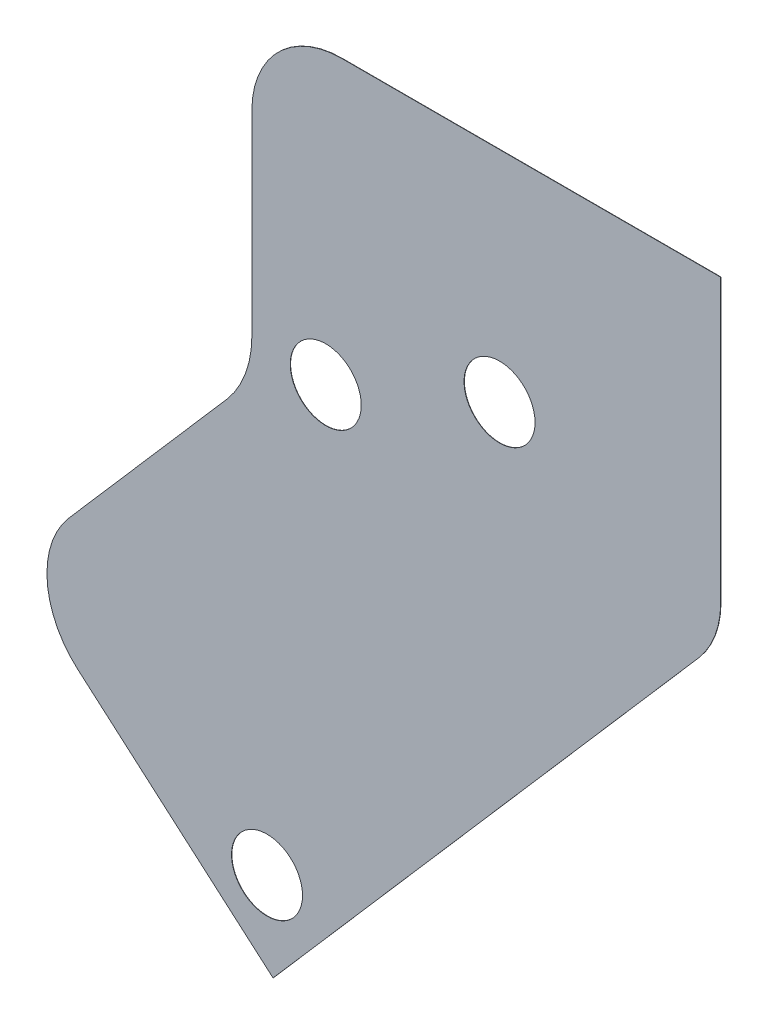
from build123d import *

# Parameters (mm, degrees)
BOSS_EXTRUDE1_DEPTH = 0.0254
HOLE1_D             = 5.6134


with BuildPart() as part:
    # Sketch1 → Boss-Extrude1 (new body)
    with BuildSketch(Plane.XY):
        with BuildLine():
            Line((-664.083, -35.989792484), (-664.083, -13.707872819))
            Line((-664.083, -13.707872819), (-694.055, -13.707872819))
            ThreePointArc((-694.055, -13.707872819), (-699.083943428, -15.790929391), (-701.167, -20.819872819))
            Line((-701.167, -20.819872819), (-701.167, -36.282075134))
            ThreePointArc((-701.167, -36.282075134), (-701.681033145, -39.126700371), (-703.158115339, -41.61152451))
            Line((-703.158115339, -41.61152451), (-715.634869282, -55.97856217))
            ThreePointArc((-715.634869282, -55.97856217), (-717.359527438, -61.141405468), (-714.928363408, -66.011604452))
            Line((-714.928363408, -66.011604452), (-699.490262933, -79.41850054))
            Line((-699.490262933, -79.41850054), (-665.825225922, -40.653060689))
            ThreePointArc((-665.825225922, -40.653060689), (-664.532779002, -38.478839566), (-664.083, -35.989792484))
        make_face()
    extrude(amount=BOSS_EXTRUDE1_DEPTH)

    # Hole1 (through all)
    with Locations(Plane(origin=(-698.979260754, -26.093732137, 0.0254), x_dir=(1, 0, 0), z_dir=(0, 0, 1))):
        with Locations((3.654260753, -10.601140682), (17.402464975, -4.91486015), (-0.99041688, -46.516632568)):
            Hole(HOLE1_D / 2)


solid = part.part
